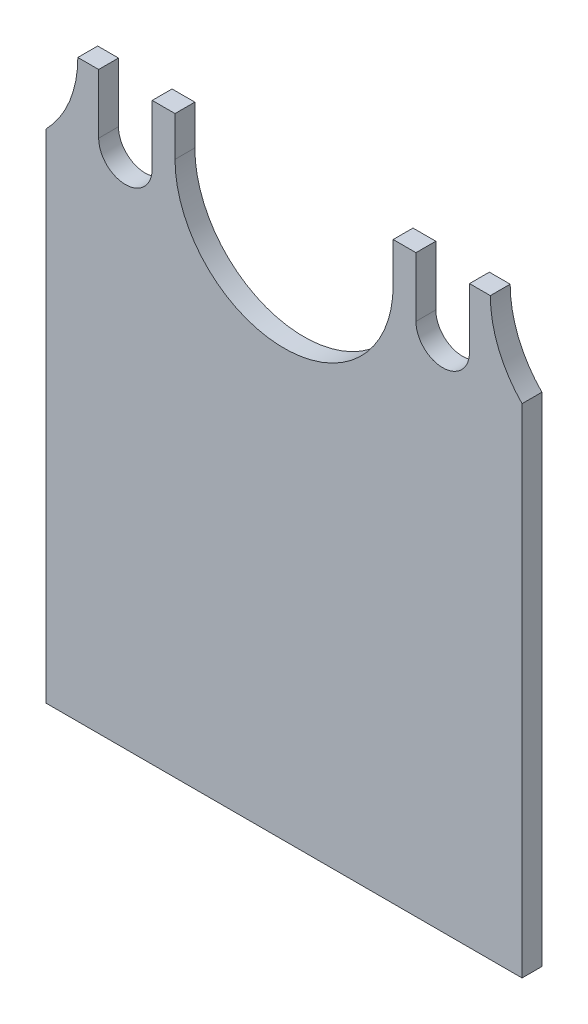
from build123d import *

# Parameters (mm, degrees)
LINEAR_AUSTRAGEN1_DEPTH = 5


with BuildPart() as part:
    # Skizze1 → Linear austragen1 (new body)
    with BuildSketch(Plane.XY):
        with BuildLine():
            Line((13.25, 130), (13.25, 145))
            Line((13.25, 145), (8, 145))
            ThreePointArc((8, 145), (5.922962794, 134.416994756), (0, 125.404082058))
            Line((0, 125.404082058), (0, 0))
            Line((0, 0), (120, 0))
            Line((120, 0), (120, 125.404082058))
            ThreePointArc((120, 125.404082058), (114.077037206, 134.416994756), (112, 145))
            Line((112, 145), (106.75, 145))
            Line((106.75, 145), (106.75, 130))
            ThreePointArc((106.75, 130), (100, 123.25), (93.25, 130))
            Line((93.25, 130), (93.25, 145))
            Line((93.25, 145), (87.5, 145))
            Line((87.5, 145), (87.5, 135))
            ThreePointArc((87.5, 135), (60, 107.5), (32.5, 135))
            Line((32.5, 135), (32.5, 145))
            Line((32.5, 145), (26.75, 145))
            Line((26.75, 145), (26.75, 130))
            ThreePointArc((26.75, 130), (20, 123.25), (13.25, 130))
        make_face()
    extrude(amount=LINEAR_AUSTRAGEN1_DEPTH)


solid = part.part
